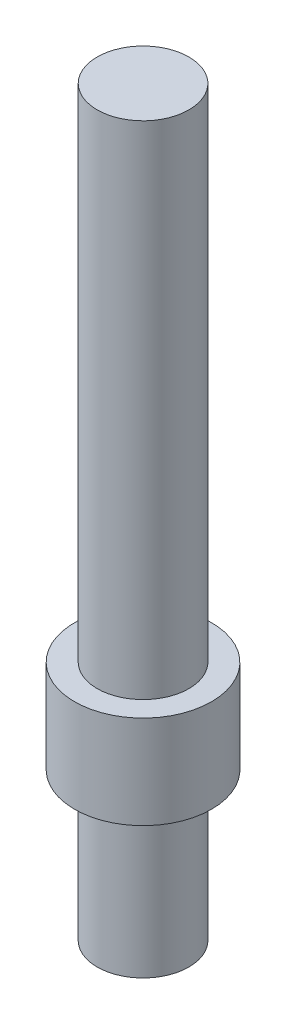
from build123d import *

# Parameters (mm, degrees)
SKETCH1_R      = 17
EXTRUDE1_DEPTH = 185.866248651
SKETCH3_R      = 25.4
EXTRUDE2_DEPTH = 34.544
SKETCH4_R      = 17
EXTRUDE3_DEPTH = 54.864
SHELL1_T       = -2.54


with BuildPart() as part:
    # Sketch1 → Extrude1 (new body)
    with BuildSketch(Plane(origin=(-807.961693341, 0, -44.779166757), x_dir=(-0.9939682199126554, 0, -0.10966849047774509), z_dir=(0, 1, 0))):
        with Locations(Location((-807.999109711, -44.098870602, 0), (0, 0, 276.296205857))):
            Circle(SKETCH1_R)
    extrude(amount=-EXTRUDE1_DEPTH)

    # Sketch3 → Extrude2 (add)
    with BuildSketch(Plane(origin=(0, -185.866248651, 0), x_dir=(0.9937806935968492, 0, 0.11135498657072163), z_dir=(0, -1, 0))):
        with Locations(Location((0, 0, 0), (0, 0, 353.606569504))):
            Circle(SKETCH3_R)
    extrude(amount=EXTRUDE2_DEPTH)

    # Sketch4 → Extrude3 (add)
    with BuildSketch(Plane(origin=(0, -220.410248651, 0), x_dir=(0.9937806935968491, 0, 0.1113549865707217), z_dir=(0, -1, 0))):
        with Locations(Location((0, 0, 0), (0, 0, 353.606569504))):
            Circle(SKETCH4_R)
    extrude(amount=EXTRUDE3_DEPTH)

    # Shell1
    shell1_openings = [part.faces().sort_by_distance(p)[0] for p in [
        (0, -275.274248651, 0),
    ]]
    offset(amount=SHELL1_T, openings=shell1_openings, kind=Kind.INTERSECTION)


solid = part.part
